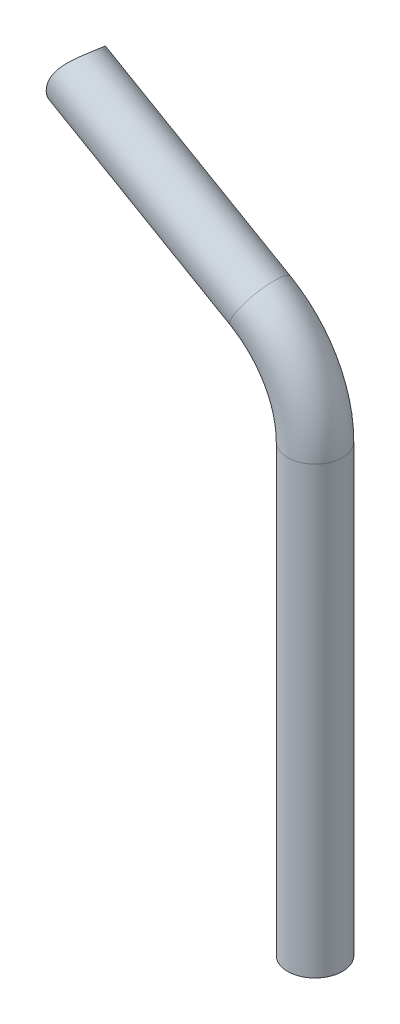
from build123d import *

# Parameters (mm, degrees)
ESQUISSE2_R             = 15
ESQUISSE2_R_2           = 13
ESQUISSE3_R             = 30
ENL_V_MAT_EXTRU_1_DEPTH = 60


with BuildPart() as part:
    # Balayage1: sweep along a path in Esquisse1
    with BuildLine(Plane.XY) as balayage1_path:
        Line((0, 0), (125, -72.168783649))
        ThreePointArc((125, -72.168783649), (146.961524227, -94.130307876), (155, -124.130307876))
        Line((155, -124.130307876), (155, -367.489291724))
    # Esquisse2 → Balayage1 (sweep)
    with BuildSketch(Plane(origin=(0, -367.489291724, 0), x_dir=(-1, 0, 0), z_dir=(0, 1, 0))):
        with Locations((-155, 0)):
            Circle(ESQUISSE2_R)
        with Locations((-155, 0)):
            Circle(ESQUISSE2_R_2, mode=Mode.SUBTRACT)
    sweep(path=balayage1_path.line)

    # Esquisse3 → Enl_v. mat.-Extru.1 (cut)
    with BuildSketch(Plane(origin=(8.797063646, 20.085807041, -6.940607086), x_dir=(0.9231002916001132, -0.34705621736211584, 0.16564369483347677), z_dir=(0.3824810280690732, 0.8732959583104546, -0.30176552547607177))):
        Circle(ESQUISSE3_R)
    extrude(amount=-ENL_V_MAT_EXTRU_1_DEPTH, mode=Mode.SUBTRACT)


solid = part.part
